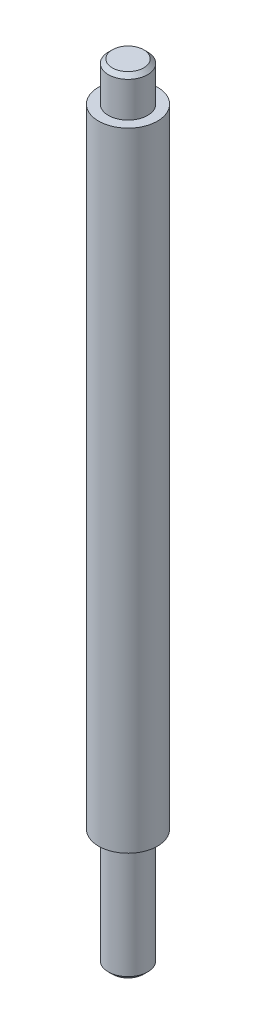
ISO-10303-21;
HEADER;
FILE_DESCRIPTION(('STEP AP214'),'2;1');
FILE_NAME('part.step','',(''),(''),'','','');
FILE_SCHEMA(('AUTOMOTIVE_DESIGN { 1 0 10303 214 1 1 1 1 }'));
ENDSEC;
DATA;
#1=APPLICATION_CONTEXT('core data for automotive mechanical design processes');
#2=APPLICATION_PROTOCOL_DEFINITION('international standard','automotive_design',2000,#1);
#3=PRODUCT_CONTEXT('',#1,'mechanical');
#4=PRODUCT('Part','Part','',(#3));
#5=PRODUCT_RELATED_PRODUCT_CATEGORY('part','',(#4));
#6=PRODUCT_DEFINITION_FORMATION('','',#4);
#7=PRODUCT_DEFINITION_CONTEXT('part definition',#1,'design');
#8=PRODUCT_DEFINITION('design','',#6,#7);
#9=PRODUCT_DEFINITION_SHAPE('','',#8);
#10=(LENGTH_UNIT() NAMED_UNIT(*) SI_UNIT(.MILLI.,.METRE.));
#11=(NAMED_UNIT(*) PLANE_ANGLE_UNIT() SI_UNIT($,.RADIAN.));
#12=(NAMED_UNIT(*) SI_UNIT($,.STERADIAN.) SOLID_ANGLE_UNIT());
#13=UNCERTAINTY_MEASURE_WITH_UNIT(LENGTH_MEASURE(1.E-05),#10,'distance_accuracy_value','');
#14=(GEOMETRIC_REPRESENTATION_CONTEXT(3) GLOBAL_UNCERTAINTY_ASSIGNED_CONTEXT((#13)) GLOBAL_UNIT_ASSIGNED_CONTEXT((#10,
#11,#12)) REPRESENTATION_CONTEXT('',''));
#15=CARTESIAN_POINT('',(0.,0.,0.));
#16=DIRECTION('',(0.,0.,1.));
#17=DIRECTION('',(1.,0.,0.));
#18=AXIS2_PLACEMENT_3D('',#15,#16,#17);
#19=CARTESIAN_POINT('',(0.,0.,0.));
#20=DIRECTION('',(0.,1.,0.));
#21=DIRECTION('',(0.,0.,1.));
#22=AXIS2_PLACEMENT_3D('',#19,#20,#21);
#23=PLANE('',#22);
#24=CARTESIAN_POINT('',(0.,0.,0.));
#25=DIRECTION('',(0.,1.,0.));
#26=DIRECTION('',(0.,0.,1.));
#27=AXIS2_PLACEMENT_3D('',#24,#25,#26);
#28=CIRCLE('',#27,7.99999999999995);
#29=CARTESIAN_POINT('',(0.,0.,7.99999999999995));
#30=VERTEX_POINT('',#29);
#31=EDGE_CURVE('E36',#30,#30,#28,.F.);
#32=ORIENTED_EDGE('',*,*,#31,.T.);
#33=EDGE_LOOP('',(#32));
#34=FACE_BOUND('',#33,.T.);
#35=ADVANCED_FACE('F30',(#34),#23,.F.);
#36=CARTESIAN_POINT('',(0.,0.,0.));
#37=DIRECTION('',(0.,-1.,0.));
#38=DIRECTION('',(0.,0.,-1.));
#39=AXIS2_PLACEMENT_3D('',#36,#37,#38);
#40=CYLINDRICAL_SURFACE('',#39,9.99999999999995);
#41=CARTESIAN_POINT('',(0.,2.00000000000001,0.));
#42=DIRECTION('',(0.,1.,0.));
#43=DIRECTION('',(0.,0.,1.));
#44=AXIS2_PLACEMENT_3D('',#41,#42,#43);
#45=CIRCLE('',#44,9.99999999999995);
#46=CARTESIAN_POINT('',(0.,2.00000000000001,9.99999999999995));
#47=VERTEX_POINT('',#46);
#48=EDGE_CURVE('E10',#47,#47,#45,.T.);
#49=ORIENTED_EDGE('',*,*,#48,.T.);
#50=EDGE_LOOP('',(#49));
#51=FACE_BOUND('',#50,.T.);
#52=CARTESIAN_POINT('',(0.,60.,0.));
#53=DIRECTION('',(0.,-1.,0.));
#54=DIRECTION('',(0.,0.,-1.));
#55=AXIS2_PLACEMENT_3D('',#52,#53,#54);
#56=CIRCLE('',#55,9.99999999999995);
#57=CARTESIAN_POINT('',(0.,60.,-9.99999999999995));
#58=VERTEX_POINT('',#57);
#59=EDGE_CURVE('E49',#58,#58,#56,.T.);
#60=ORIENTED_EDGE('',*,*,#59,.T.);
#61=EDGE_LOOP('',(#60));
#62=FACE_BOUND('',#61,.T.);
#63=ADVANCED_FACE('F80',(#51,#62),#40,.T.);
#64=CARTESIAN_POINT('',(-9.99999999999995,60.,0.));
#65=DIRECTION('',(0.,1.,0.));
#66=DIRECTION('',(0.,0.,1.));
#67=AXIS2_PLACEMENT_3D('',#64,#65,#66);
#68=PLANE('',#67);
#69=ORIENTED_EDGE('',*,*,#59,.F.);
#70=EDGE_LOOP('',(#69));
#71=FACE_BOUND('',#70,.T.);
#72=CARTESIAN_POINT('',(0.,60.,0.));
#73=DIRECTION('',(0.,-1.,0.));
#74=DIRECTION('',(0.,0.,-1.));
#75=AXIS2_PLACEMENT_3D('',#72,#73,#74);
#76=CIRCLE('',#75,15.);
#77=CARTESIAN_POINT('',(0.,60.,-15.));
#78=VERTEX_POINT('',#77);
#79=EDGE_CURVE('E52',#78,#78,#76,.T.);
#80=ORIENTED_EDGE('',*,*,#79,.T.);
#81=EDGE_LOOP('',(#80));
#82=FACE_BOUND('',#81,.T.);
#83=ADVANCED_FACE('F84',(#71,#82),#68,.F.);
#84=CARTESIAN_POINT('',(0.,0.,0.));
#85=DIRECTION('',(0.,-1.,0.));
#86=DIRECTION('',(0.,0.,-1.));
#87=AXIS2_PLACEMENT_3D('',#84,#85,#86);
#88=CYLINDRICAL_SURFACE('',#87,15.);
#89=ORIENTED_EDGE('',*,*,#79,.F.);
#90=EDGE_LOOP('',(#89));
#91=FACE_BOUND('',#90,.T.);
#92=CARTESIAN_POINT('',(0.,380.,0.));
#93=DIRECTION('',(0.,-1.,0.));
#94=DIRECTION('',(0.,0.,-1.));
#95=AXIS2_PLACEMENT_3D('',#92,#93,#94);
#96=CIRCLE('',#95,15.);
#97=CARTESIAN_POINT('',(0.,380.,-15.));
#98=VERTEX_POINT('',#97);
#99=EDGE_CURVE('E55',#98,#98,#96,.T.);
#100=ORIENTED_EDGE('',*,*,#99,.T.);
#101=EDGE_LOOP('',(#100));
#102=FACE_BOUND('',#101,.T.);
#103=ADVANCED_FACE('F76',(#91,#102),#88,.T.);
#104=CARTESIAN_POINT('',(-15.,380.,0.));
#105=DIRECTION('',(0.,-1.,0.));
#106=DIRECTION('',(0.,0.,-1.));
#107=AXIS2_PLACEMENT_3D('',#104,#105,#106);
#108=PLANE('',#107);
#109=ORIENTED_EDGE('',*,*,#99,.F.);
#110=EDGE_LOOP('',(#109));
#111=FACE_BOUND('',#110,.T.);
#112=CARTESIAN_POINT('',(0.,380.,0.));
#113=DIRECTION('',(0.,-1.,0.));
#114=DIRECTION('',(0.,0.,-1.));
#115=AXIS2_PLACEMENT_3D('',#112,#113,#114);
#116=CIRCLE('',#115,9.99999999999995);
#117=CARTESIAN_POINT('',(0.,380.,-9.99999999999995));
#118=VERTEX_POINT('',#117);
#119=EDGE_CURVE('E58',#118,#118,#116,.T.);
#120=ORIENTED_EDGE('',*,*,#119,.T.);
#121=EDGE_LOOP('',(#120));
#122=FACE_BOUND('',#121,.T.);
#123=ADVANCED_FACE('F62',(#111,#122),#108,.F.);
#124=CARTESIAN_POINT('',(0.,0.,0.));
#125=DIRECTION('',(0.,-1.,0.));
#126=DIRECTION('',(0.,0.,-1.));
#127=AXIS2_PLACEMENT_3D('',#124,#125,#126);
#128=CYLINDRICAL_SURFACE('',#127,9.99999999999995);
#129=CARTESIAN_POINT('',(0.,398.,0.));
#130=DIRECTION('',(0.,-1.,0.));
#131=DIRECTION('',(0.,0.,-1.));
#132=AXIS2_PLACEMENT_3D('',#129,#130,#131);
#133=CIRCLE('',#132,9.99999999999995);
#134=CARTESIAN_POINT('',(0.,398.,-9.99999999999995));
#135=VERTEX_POINT('',#134);
#136=EDGE_CURVE('E44',#135,#135,#133,.T.);
#137=ORIENTED_EDGE('',*,*,#136,.T.);
#138=EDGE_LOOP('',(#137));
#139=FACE_BOUND('',#138,.T.);
#140=ORIENTED_EDGE('',*,*,#119,.F.);
#141=EDGE_LOOP('',(#140));
#142=FACE_BOUND('',#141,.T.);
#143=ADVANCED_FACE('F64',(#139,#142),#128,.T.);
#144=CARTESIAN_POINT('',(-9.99999999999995,400.,0.));
#145=DIRECTION('',(0.,-1.,0.));
#146=DIRECTION('',(0.,0.,-1.));
#147=AXIS2_PLACEMENT_3D('',#144,#145,#146);
#148=PLANE('',#147);
#149=CARTESIAN_POINT('',(0.,400.,0.));
#150=DIRECTION('',(0.,-1.,0.));
#151=DIRECTION('',(0.,0.,-1.));
#152=AXIS2_PLACEMENT_3D('',#149,#150,#151);
#153=CIRCLE('',#152,7.99999999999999);
#154=CARTESIAN_POINT('',(0.,400.,-7.99999999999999));
#155=VERTEX_POINT('',#154);
#156=EDGE_CURVE('E40',#155,#155,#153,.F.);
#157=ORIENTED_EDGE('',*,*,#156,.T.);
#158=EDGE_LOOP('',(#157));
#159=FACE_BOUND('',#158,.T.);
#160=ADVANCED_FACE('F66',(#159),#148,.F.);
#161=CARTESIAN_POINT('',(0.,398.,0.));
#162=DIRECTION('',(0.,-1.,0.));
#163=DIRECTION('',(0.,0.,-1.));
#164=AXIS2_PLACEMENT_3D('',#161,#162,#163);
#165=CONICAL_SURFACE('',#164,9.99999999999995,0.785398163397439);
#166=ORIENTED_EDGE('',*,*,#156,.F.);
#167=EDGE_LOOP('',(#166));
#168=FACE_BOUND('',#167,.T.);
#169=ORIENTED_EDGE('',*,*,#136,.F.);
#170=EDGE_LOOP('',(#169));
#171=FACE_BOUND('',#170,.T.);
#172=ADVANCED_FACE('F73',(#168,#171),#165,.T.);
#173=CARTESIAN_POINT('',(0.,0.,0.));
#174=DIRECTION('',(0.,1.,0.));
#175=DIRECTION('',(0.,0.,1.));
#176=AXIS2_PLACEMENT_3D('',#173,#174,#175);
#177=CONICAL_SURFACE('',#176,7.99999999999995,0.785398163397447);
#178=ORIENTED_EDGE('',*,*,#48,.F.);
#179=EDGE_LOOP('',(#178));
#180=FACE_BOUND('',#179,.T.);
#181=ORIENTED_EDGE('',*,*,#31,.F.);
#182=EDGE_LOOP('',(#181));
#183=FACE_BOUND('',#182,.T.);
#184=ADVANCED_FACE('F125',(#180,#183),#177,.T.);
#185=CLOSED_SHELL('',(#35,#63,#83,#103,#123,#143,#160,#172,#184));
#186=MANIFOLD_SOLID_BREP('B2',#185);
#187=ADVANCED_BREP_SHAPE_REPRESENTATION('',(#18,#186),#14);
#188=SHAPE_DEFINITION_REPRESENTATION(#9,#187);
ENDSEC;
END-ISO-10303-21;
